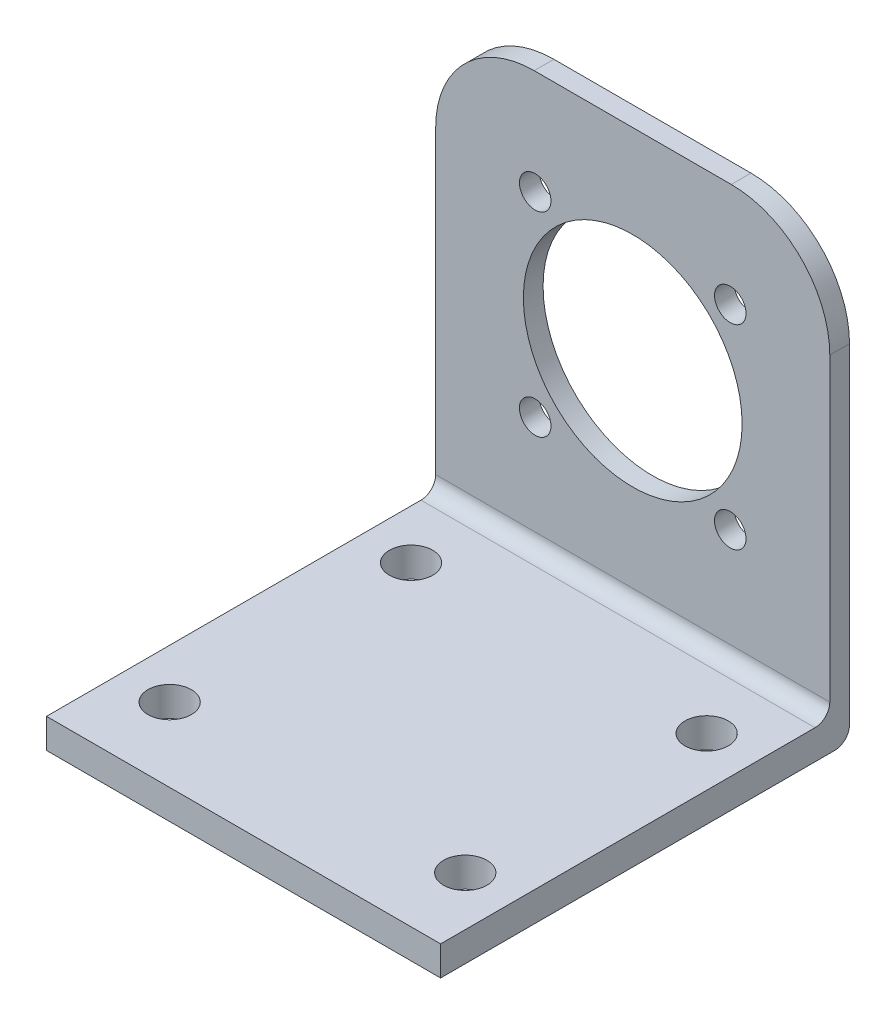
ISO-10303-21;
HEADER;
FILE_DESCRIPTION(('STEP AP214'),'2;1');
FILE_NAME('part.step','',(''),(''),'','','');
FILE_SCHEMA(('AUTOMOTIVE_DESIGN { 1 0 10303 214 1 1 1 1 }'));
ENDSEC;
DATA;
#1=APPLICATION_CONTEXT('core data for automotive mechanical design processes');
#2=APPLICATION_PROTOCOL_DEFINITION('international standard','automotive_design',2000,#1);
#3=PRODUCT_CONTEXT('',#1,'mechanical');
#4=PRODUCT('Part','Part','',(#3));
#5=PRODUCT_RELATED_PRODUCT_CATEGORY('part','',(#4));
#6=PRODUCT_DEFINITION_FORMATION('','',#4);
#7=PRODUCT_DEFINITION_CONTEXT('part definition',#1,'design');
#8=PRODUCT_DEFINITION('design','',#6,#7);
#9=PRODUCT_DEFINITION_SHAPE('','',#8);
#10=(LENGTH_UNIT() NAMED_UNIT(*) SI_UNIT(.MILLI.,.METRE.));
#11=(NAMED_UNIT(*) PLANE_ANGLE_UNIT() SI_UNIT($,.RADIAN.));
#12=(NAMED_UNIT(*) SI_UNIT($,.STERADIAN.) SOLID_ANGLE_UNIT());
#13=UNCERTAINTY_MEASURE_WITH_UNIT(LENGTH_MEASURE(1.E-05),#10,'distance_accuracy_value','');
#14=(GEOMETRIC_REPRESENTATION_CONTEXT(3) GLOBAL_UNCERTAINTY_ASSIGNED_CONTEXT((#13)) GLOBAL_UNIT_ASSIGNED_CONTEXT((#10,
#11,#12)) REPRESENTATION_CONTEXT('',''));
#15=CARTESIAN_POINT('',(0.,0.,0.));
#16=DIRECTION('',(0.,0.,1.));
#17=DIRECTION('',(1.,0.,0.));
#18=AXIS2_PLACEMENT_3D('',#15,#16,#17);
#19=CARTESIAN_POINT('',(9.99999999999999,12.5,2.));
#20=DIRECTION('',(0.,0.,-1.));
#21=DIRECTION('',(-1.,0.,0.));
#22=AXIS2_PLACEMENT_3D('',#19,#20,#21);
#23=PLANE('',#22);
#24=CARTESIAN_POINT('',(-9.89949493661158,11.8994949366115,2.));
#25=DIRECTION('',(0.,0.,1.));
#26=DIRECTION('',(1.,0.,0.));
#27=AXIS2_PLACEMENT_3D('',#24,#25,#26);
#28=CIRCLE('',#27,1.6);
#29=CARTESIAN_POINT('',(-8.29949493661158,11.8994949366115,2.));
#30=VERTEX_POINT('',#29);
#31=EDGE_CURVE('E427',#30,#30,#28,.T.);
#32=ORIENTED_EDGE('',*,*,#31,.F.);
#33=EDGE_LOOP('',(#32));
#34=FACE_BOUND('',#33,.T.);
#35=CARTESIAN_POINT('',(-9.89949493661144,-7.89949493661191,2.));
#36=DIRECTION('',(0.,0.,1.));
#37=DIRECTION('',(1.,0.,0.));
#38=AXIS2_PLACEMENT_3D('',#35,#36,#37);
#39=CIRCLE('',#38,1.6);
#40=CARTESIAN_POINT('',(-8.29949493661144,-7.89949493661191,2.));
#41=VERTEX_POINT('',#40);
#42=EDGE_CURVE('E428',#41,#41,#39,.T.);
#43=ORIENTED_EDGE('',*,*,#42,.F.);
#44=EDGE_LOOP('',(#43));
#45=FACE_BOUND('',#44,.T.);
#46=CARTESIAN_POINT('',(9.89949493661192,-7.8994949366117,2.));
#47=DIRECTION('',(0.,0.,1.));
#48=DIRECTION('',(1.,0.,0.));
#49=AXIS2_PLACEMENT_3D('',#46,#47,#48);
#50=CIRCLE('',#49,1.6);
#51=CARTESIAN_POINT('',(11.4994949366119,-7.8994949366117,2.));
#52=VERTEX_POINT('',#51);
#53=EDGE_CURVE('E431',#52,#52,#50,.T.);
#54=ORIENTED_EDGE('',*,*,#53,.F.);
#55=EDGE_LOOP('',(#54));
#56=FACE_BOUND('',#55,.T.);
#57=CARTESIAN_POINT('',(9.89949493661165,11.8994949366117,2.));
#58=DIRECTION('',(0.,0.,1.));
#59=DIRECTION('',(1.,0.,0.));
#60=AXIS2_PLACEMENT_3D('',#57,#58,#59);
#61=CIRCLE('',#60,1.6);
#62=CARTESIAN_POINT('',(11.4994949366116,11.8994949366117,2.));
#63=VERTEX_POINT('',#62);
#64=EDGE_CURVE('E203',#63,#63,#61,.T.);
#65=ORIENTED_EDGE('',*,*,#64,.F.);
#66=EDGE_LOOP('',(#65));
#67=FACE_BOUND('',#66,.T.);
#68=DIRECTION('',(0.,-1.,0.));
#69=VECTOR('',#68,1.);
#70=CARTESIAN_POINT('',(-20.,12.5,2.));
#71=LINE('',#70,#69);
#72=CARTESIAN_POINT('',(-20.,12.5,2.));
#73=VERTEX_POINT('',#72);
#74=CARTESIAN_POINT('',(-20.,-18.,2.));
#75=VERTEX_POINT('',#74);
#76=EDGE_CURVE('E148',#73,#75,#71,.T.);
#77=ORIENTED_EDGE('',*,*,#76,.T.);
#78=DIRECTION('',(1.,0.,0.));
#79=VECTOR('',#78,1.);
#80=CARTESIAN_POINT('',(10.,-18.,2.));
#81=LINE('',#80,#79);
#82=CARTESIAN_POINT('',(20.,-18.,2.));
#83=VERTEX_POINT('',#82);
#84=EDGE_CURVE('E194',#75,#83,#81,.T.);
#85=ORIENTED_EDGE('',*,*,#84,.T.);
#86=DIRECTION('',(0.,1.,0.));
#87=VECTOR('',#86,1.);
#88=CARTESIAN_POINT('',(20.,12.5,2.));
#89=LINE('',#88,#87);
#90=CARTESIAN_POINT('',(20.,12.5,2.));
#91=VERTEX_POINT('',#90);
#92=EDGE_CURVE('E150',#83,#91,#89,.T.);
#93=ORIENTED_EDGE('',*,*,#92,.T.);
#94=CARTESIAN_POINT('',(9.99999999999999,12.5,2.));
#95=DIRECTION('',(0.,0.,1.));
#96=DIRECTION('',(-1.,0.,0.));
#97=AXIS2_PLACEMENT_3D('',#94,#95,#96);
#98=CIRCLE('',#97,10.);
#99=CARTESIAN_POINT('',(9.99999999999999,22.5,2.));
#100=VERTEX_POINT('',#99);
#101=EDGE_CURVE('E153',#91,#100,#98,.T.);
#102=ORIENTED_EDGE('',*,*,#101,.T.);
#103=DIRECTION('',(-1.,0.,0.));
#104=VECTOR('',#103,1.);
#105=CARTESIAN_POINT('',(9.99999999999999,22.5,2.));
#106=LINE('',#105,#104);
#107=CARTESIAN_POINT('',(-10.,22.5,2.));
#108=VERTEX_POINT('',#107);
#109=EDGE_CURVE('E155',#100,#108,#106,.T.);
#110=ORIENTED_EDGE('',*,*,#109,.T.);
#111=CARTESIAN_POINT('',(-10.,12.5,2.));
#112=DIRECTION('',(0.,0.,1.));
#113=DIRECTION('',(1.,0.,0.));
#114=AXIS2_PLACEMENT_3D('',#111,#112,#113);
#115=CIRCLE('',#114,10.);
#116=EDGE_CURVE('E157',#108,#73,#115,.T.);
#117=ORIENTED_EDGE('',*,*,#116,.T.);
#118=EDGE_LOOP('',(#77,#85,#93,#102,#110,#117));
#119=FACE_BOUND('',#118,.T.);
#120=CARTESIAN_POINT('',(0.,1.99999999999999,2.));
#121=DIRECTION('',(0.,0.,1.));
#122=DIRECTION('',(1.,0.,0.));
#123=AXIS2_PLACEMENT_3D('',#120,#121,#122);
#124=CIRCLE('',#123,11.1);
#125=CARTESIAN_POINT('',(11.1,1.99999999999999,2.));
#126=VERTEX_POINT('',#125);
#127=EDGE_CURVE('E142',#126,#126,#124,.T.);
#128=ORIENTED_EDGE('',*,*,#127,.F.);
#129=EDGE_LOOP('',(#128));
#130=FACE_BOUND('',#129,.T.);
#131=ADVANCED_FACE('F36',(#34,#45,#56,#67,#119,#130),#23,.F.);
#132=CARTESIAN_POINT('',(9.99999999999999,12.5,0.));
#133=DIRECTION('',(0.,0.,-1.));
#134=DIRECTION('',(-1.,0.,0.));
#135=AXIS2_PLACEMENT_3D('',#132,#133,#134);
#136=PLANE('',#135);
#137=CARTESIAN_POINT('',(-9.89949493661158,11.8994949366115,0.));
#138=DIRECTION('',(0.,0.,-1.));
#139=DIRECTION('',(-1.,0.,0.));
#140=AXIS2_PLACEMENT_3D('',#137,#138,#139);
#141=CIRCLE('',#140,1.6);
#142=CARTESIAN_POINT('',(-11.4994949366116,11.8994949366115,0.));
#143=VERTEX_POINT('',#142);
#144=EDGE_CURVE('E40',#143,#143,#141,.T.);
#145=ORIENTED_EDGE('',*,*,#144,.F.);
#146=EDGE_LOOP('',(#145));
#147=FACE_BOUND('',#146,.T.);
#148=CARTESIAN_POINT('',(-9.89949493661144,-7.89949493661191,0.));
#149=DIRECTION('',(0.,0.,-1.));
#150=DIRECTION('',(-1.,0.,0.));
#151=AXIS2_PLACEMENT_3D('',#148,#149,#150);
#152=CIRCLE('',#151,1.6);
#153=CARTESIAN_POINT('',(-11.4994949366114,-7.89949493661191,0.));
#154=VERTEX_POINT('',#153);
#155=EDGE_CURVE('E205',#154,#154,#152,.T.);
#156=ORIENTED_EDGE('',*,*,#155,.F.);
#157=EDGE_LOOP('',(#156));
#158=FACE_BOUND('',#157,.T.);
#159=CARTESIAN_POINT('',(9.89949493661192,-7.8994949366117,0.));
#160=DIRECTION('',(0.,0.,-1.));
#161=DIRECTION('',(-1.,0.,0.));
#162=AXIS2_PLACEMENT_3D('',#159,#160,#161);
#163=CIRCLE('',#162,1.6);
#164=CARTESIAN_POINT('',(8.29949493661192,-7.8994949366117,0.));
#165=VERTEX_POINT('',#164);
#166=EDGE_CURVE('E202',#165,#165,#163,.T.);
#167=ORIENTED_EDGE('',*,*,#166,.F.);
#168=EDGE_LOOP('',(#167));
#169=FACE_BOUND('',#168,.T.);
#170=CARTESIAN_POINT('',(9.89949493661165,11.8994949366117,0.));
#171=DIRECTION('',(0.,0.,-1.));
#172=DIRECTION('',(-1.,0.,0.));
#173=AXIS2_PLACEMENT_3D('',#170,#171,#172);
#174=CIRCLE('',#173,1.6);
#175=CARTESIAN_POINT('',(8.29949493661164,11.8994949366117,0.));
#176=VERTEX_POINT('',#175);
#177=EDGE_CURVE('E199',#176,#176,#174,.T.);
#178=ORIENTED_EDGE('',*,*,#177,.F.);
#179=EDGE_LOOP('',(#178));
#180=FACE_BOUND('',#179,.T.);
#181=DIRECTION('',(0.,1.,0.));
#182=VECTOR('',#181,1.);
#183=CARTESIAN_POINT('',(20.,12.5,0.));
#184=LINE('',#183,#182);
#185=CARTESIAN_POINT('',(20.,-21.,0.));
#186=VERTEX_POINT('',#185);
#187=CARTESIAN_POINT('',(20.,12.5,0.));
#188=VERTEX_POINT('',#187);
#189=EDGE_CURVE('E162',#186,#188,#184,.T.);
#190=ORIENTED_EDGE('',*,*,#189,.F.);
#191=DIRECTION('',(1.,0.,0.));
#192=VECTOR('',#191,1.);
#193=CARTESIAN_POINT('',(-20.,-21.,0.));
#194=LINE('',#193,#192);
#195=CARTESIAN_POINT('',(-20.,-21.,0.));
#196=VERTEX_POINT('',#195);
#197=EDGE_CURVE('E190',#186,#196,#194,.F.);
#198=ORIENTED_EDGE('',*,*,#197,.T.);
#199=DIRECTION('',(0.,-1.,0.));
#200=VECTOR('',#199,1.);
#201=CARTESIAN_POINT('',(-20.,12.5,0.));
#202=LINE('',#201,#200);
#203=CARTESIAN_POINT('',(-20.,12.5,0.));
#204=VERTEX_POINT('',#203);
#205=EDGE_CURVE('E145',#204,#196,#202,.T.);
#206=ORIENTED_EDGE('',*,*,#205,.F.);
#207=CARTESIAN_POINT('',(-10.,12.5,0.));
#208=DIRECTION('',(0.,0.,1.));
#209=DIRECTION('',(1.,0.,0.));
#210=AXIS2_PLACEMENT_3D('',#207,#208,#209);
#211=CIRCLE('',#210,10.);
#212=CARTESIAN_POINT('',(-10.,22.5,0.));
#213=VERTEX_POINT('',#212);
#214=EDGE_CURVE('E151',#213,#204,#211,.T.);
#215=ORIENTED_EDGE('',*,*,#214,.F.);
#216=DIRECTION('',(-1.,0.,0.));
#217=VECTOR('',#216,1.);
#218=CARTESIAN_POINT('',(9.99999999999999,22.5,0.));
#219=LINE('',#218,#217);
#220=CARTESIAN_POINT('',(9.99999999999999,22.5,0.));
#221=VERTEX_POINT('',#220);
#222=EDGE_CURVE('E166',#221,#213,#219,.T.);
#223=ORIENTED_EDGE('',*,*,#222,.F.);
#224=CARTESIAN_POINT('',(9.99999999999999,12.5,0.));
#225=DIRECTION('',(0.,0.,1.));
#226=DIRECTION('',(-1.,0.,0.));
#227=AXIS2_PLACEMENT_3D('',#224,#225,#226);
#228=CIRCLE('',#227,10.);
#229=EDGE_CURVE('E164',#188,#221,#228,.T.);
#230=ORIENTED_EDGE('',*,*,#229,.F.);
#231=EDGE_LOOP('',(#190,#198,#206,#215,#223,#230));
#232=FACE_BOUND('',#231,.T.);
#233=CARTESIAN_POINT('',(0.,1.99999999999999,0.));
#234=DIRECTION('',(0.,0.,1.));
#235=DIRECTION('',(1.,0.,0.));
#236=AXIS2_PLACEMENT_3D('',#233,#234,#235);
#237=CIRCLE('',#236,11.1);
#238=CARTESIAN_POINT('',(11.1,1.99999999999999,0.));
#239=VERTEX_POINT('',#238);
#240=EDGE_CURVE('E141',#239,#239,#237,.T.);
#241=ORIENTED_EDGE('',*,*,#240,.T.);
#242=EDGE_LOOP('',(#241));
#243=FACE_BOUND('',#242,.T.);
#244=ADVANCED_FACE('F238',(#147,#158,#169,#180,#232,#243),#136,.T.);
#245=CARTESIAN_POINT('',(-20.,12.5,2.));
#246=DIRECTION('',(1.,0.,0.));
#247=DIRECTION('',(0.,1.,0.));
#248=AXIS2_PLACEMENT_3D('',#245,#246,#247);
#249=PLANE('',#248);
#250=ORIENTED_EDGE('',*,*,#205,.T.);
#251=CARTESIAN_POINT('',(-20.,-21.,1.5));
#252=DIRECTION('',(1.,0.,0.));
#253=DIRECTION('',(0.,1.,0.));
#254=AXIS2_PLACEMENT_3D('',#251,#252,#253);
#255=CIRCLE('',#254,1.5);
#256=CARTESIAN_POINT('',(-20.,-22.5,1.5));
#257=VERTEX_POINT('',#256);
#258=EDGE_CURVE('E192',#196,#257,#255,.F.);
#259=ORIENTED_EDGE('',*,*,#258,.T.);
#260=DIRECTION('',(0.,0.,-1.));
#261=VECTOR('',#260,1.);
#262=CARTESIAN_POINT('',(-20.,-22.5,2.));
#263=LINE('',#262,#261);
#264=CARTESIAN_POINT('',(-20.,-22.5,41.5));
#265=VERTEX_POINT('',#264);
#266=EDGE_CURVE('E182',#265,#257,#263,.T.);
#267=ORIENTED_EDGE('',*,*,#266,.F.);
#268=DIRECTION('',(0.,1.,0.));
#269=VECTOR('',#268,1.);
#270=CARTESIAN_POINT('',(-20.,-22.5,41.5));
#271=LINE('',#270,#269);
#272=CARTESIAN_POINT('',(-20.,-19.5,41.5));
#273=VERTEX_POINT('',#272);
#274=EDGE_CURVE('E138',#265,#273,#271,.T.);
#275=ORIENTED_EDGE('',*,*,#274,.T.);
#276=DIRECTION('',(0.,0.,-1.));
#277=VECTOR('',#276,1.);
#278=CARTESIAN_POINT('',(-20.,-19.5,0.));
#279=LINE('',#278,#277);
#280=CARTESIAN_POINT('',(-20.,-19.5,3.5));
#281=VERTEX_POINT('',#280);
#282=EDGE_CURVE('E127',#273,#281,#279,.T.);
#283=ORIENTED_EDGE('',*,*,#282,.T.);
#284=CARTESIAN_POINT('',(-20.,-18.,3.5));
#285=DIRECTION('',(1.,0.,0.));
#286=DIRECTION('',(0.,1.,0.));
#287=AXIS2_PLACEMENT_3D('',#284,#285,#286);
#288=CIRCLE('',#287,1.5);
#289=EDGE_CURVE('E11',#281,#75,#288,.T.);
#290=ORIENTED_EDGE('',*,*,#289,.T.);
#291=ORIENTED_EDGE('',*,*,#76,.F.);
#292=DIRECTION('',(0.,0.,-1.));
#293=VECTOR('',#292,1.);
#294=CARTESIAN_POINT('',(-20.,12.5,2.));
#295=LINE('',#294,#293);
#296=EDGE_CURVE('E159',#73,#204,#295,.T.);
#297=ORIENTED_EDGE('',*,*,#296,.T.);
#298=EDGE_LOOP('',(#250,#259,#267,#275,#283,#290,#291,#297));
#299=FACE_BOUND('',#298,.T.);
#300=ADVANCED_FACE('F228',(#299),#249,.F.);
#301=CARTESIAN_POINT('',(20.,-22.5,2.));
#302=DIRECTION('',(0.,1.,0.));
#303=DIRECTION('',(-1.,0.,0.));
#304=AXIS2_PLACEMENT_3D('',#301,#302,#303);
#305=PLANE('',#304);
#306=CARTESIAN_POINT('',(15.,-22.5,34.));
#307=DIRECTION('',(0.,1.,0.));
#308=DIRECTION('',(1.,0.,0.));
#309=AXIS2_PLACEMENT_3D('',#306,#307,#308);
#310=CIRCLE('',#309,2.2);
#311=CARTESIAN_POINT('',(17.2,-22.5,34.));
#312=VERTEX_POINT('',#311);
#313=EDGE_CURVE('E214',#312,#312,#310,.T.);
#314=ORIENTED_EDGE('',*,*,#313,.T.);
#315=EDGE_LOOP('',(#314));
#316=FACE_BOUND('',#315,.T.);
#317=CARTESIAN_POINT('',(15.,-22.5,9.5));
#318=DIRECTION('',(0.,1.,0.));
#319=DIRECTION('',(1.,0.,0.));
#320=AXIS2_PLACEMENT_3D('',#317,#318,#319);
#321=CIRCLE('',#320,2.2);
#322=CARTESIAN_POINT('',(17.2,-22.5,9.5));
#323=VERTEX_POINT('',#322);
#324=EDGE_CURVE('E442',#323,#323,#321,.T.);
#325=ORIENTED_EDGE('',*,*,#324,.T.);
#326=EDGE_LOOP('',(#325));
#327=FACE_BOUND('',#326,.T.);
#328=CARTESIAN_POINT('',(-15.,-22.5,9.5));
#329=DIRECTION('',(0.,1.,0.));
#330=DIRECTION('',(-1.,0.,0.));
#331=AXIS2_PLACEMENT_3D('',#328,#329,#330);
#332=CIRCLE('',#331,2.2);
#333=CARTESIAN_POINT('',(-17.2,-22.5,9.5));
#334=VERTEX_POINT('',#333);
#335=EDGE_CURVE('E227',#334,#334,#332,.T.);
#336=ORIENTED_EDGE('',*,*,#335,.T.);
#337=EDGE_LOOP('',(#336));
#338=FACE_BOUND('',#337,.T.);
#339=CARTESIAN_POINT('',(-15.,-22.5,34.));
#340=DIRECTION('',(0.,1.,0.));
#341=DIRECTION('',(-1.,0.,0.));
#342=AXIS2_PLACEMENT_3D('',#339,#340,#341);
#343=CIRCLE('',#342,2.2);
#344=CARTESIAN_POINT('',(-17.2,-22.5,34.));
#345=VERTEX_POINT('',#344);
#346=EDGE_CURVE('E122',#345,#345,#343,.T.);
#347=ORIENTED_EDGE('',*,*,#346,.T.);
#348=EDGE_LOOP('',(#347));
#349=FACE_BOUND('',#348,.T.);
#350=ORIENTED_EDGE('',*,*,#266,.T.);
#351=DIRECTION('',(1.,0.,0.));
#352=VECTOR('',#351,1.);
#353=CARTESIAN_POINT('',(20.,-22.5,1.5));
#354=LINE('',#353,#352);
#355=CARTESIAN_POINT('',(20.,-22.5,1.5));
#356=VERTEX_POINT('',#355);
#357=EDGE_CURVE('E185',#257,#356,#354,.T.);
#358=ORIENTED_EDGE('',*,*,#357,.T.);
#359=DIRECTION('',(0.,0.,-1.));
#360=VECTOR('',#359,1.);
#361=CARTESIAN_POINT('',(20.,-22.5,2.));
#362=LINE('',#361,#360);
#363=CARTESIAN_POINT('',(20.,-22.5,41.5));
#364=VERTEX_POINT('',#363);
#365=EDGE_CURVE('E180',#364,#356,#362,.T.);
#366=ORIENTED_EDGE('',*,*,#365,.F.);
#367=DIRECTION('',(1.,0.,0.));
#368=VECTOR('',#367,1.);
#369=CARTESIAN_POINT('',(-61.6082924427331,-22.5,41.5));
#370=LINE('',#369,#368);
#371=EDGE_CURVE('E130',#265,#364,#370,.T.);
#372=ORIENTED_EDGE('',*,*,#371,.F.);
#373=EDGE_LOOP('',(#350,#358,#366,#372));
#374=FACE_BOUND('',#373,.T.);
#375=ADVANCED_FACE('F230',(#316,#327,#338,#349,#374),#305,.F.);
#376=CARTESIAN_POINT('',(20.,12.5,2.));
#377=DIRECTION('',(-1.,0.,0.));
#378=DIRECTION('',(0.,-1.,0.));
#379=AXIS2_PLACEMENT_3D('',#376,#377,#378);
#380=PLANE('',#379);
#381=ORIENTED_EDGE('',*,*,#365,.T.);
#382=CARTESIAN_POINT('',(20.,-21.,1.5));
#383=DIRECTION('',(-1.,0.,0.));
#384=DIRECTION('',(0.,-1.,0.));
#385=AXIS2_PLACEMENT_3D('',#382,#383,#384);
#386=CIRCLE('',#385,1.5);
#387=EDGE_CURVE('E188',#356,#186,#386,.F.);
#388=ORIENTED_EDGE('',*,*,#387,.T.);
#389=ORIENTED_EDGE('',*,*,#189,.T.);
#390=DIRECTION('',(0.,0.,-1.));
#391=VECTOR('',#390,1.);
#392=CARTESIAN_POINT('',(20.,12.5,2.));
#393=LINE('',#392,#391);
#394=EDGE_CURVE('E177',#91,#188,#393,.T.);
#395=ORIENTED_EDGE('',*,*,#394,.F.);
#396=ORIENTED_EDGE('',*,*,#92,.F.);
#397=CARTESIAN_POINT('',(20.,-18.,3.5));
#398=DIRECTION('',(-1.,0.,0.));
#399=DIRECTION('',(0.,-1.,0.));
#400=AXIS2_PLACEMENT_3D('',#397,#398,#399);
#401=CIRCLE('',#400,1.5);
#402=CARTESIAN_POINT('',(20.,-19.5,3.5));
#403=VERTEX_POINT('',#402);
#404=EDGE_CURVE('E45',#83,#403,#401,.T.);
#405=ORIENTED_EDGE('',*,*,#404,.T.);
#406=DIRECTION('',(0.,0.,1.));
#407=VECTOR('',#406,1.);
#408=CARTESIAN_POINT('',(20.,-19.5,0.));
#409=LINE('',#408,#407);
#410=CARTESIAN_POINT('',(20.,-19.5,41.5));
#411=VERTEX_POINT('',#410);
#412=EDGE_CURVE('E115',#403,#411,#409,.T.);
#413=ORIENTED_EDGE('',*,*,#412,.T.);
#414=DIRECTION('',(0.,-1.,0.));
#415=VECTOR('',#414,1.);
#416=CARTESIAN_POINT('',(20.,-22.5,41.5));
#417=LINE('',#416,#415);
#418=EDGE_CURVE('E120',#411,#364,#417,.T.);
#419=ORIENTED_EDGE('',*,*,#418,.T.);
#420=EDGE_LOOP('',(#381,#388,#389,#395,#396,#405,#413,#419));
#421=FACE_BOUND('',#420,.T.);
#422=ADVANCED_FACE('F118',(#421),#380,.F.);
#423=CARTESIAN_POINT('',(9.99999999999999,12.5,2.));
#424=DIRECTION('',(0.,0.,-1.));
#425=DIRECTION('',(-1.,0.,0.));
#426=AXIS2_PLACEMENT_3D('',#423,#424,#425);
#427=CYLINDRICAL_SURFACE('',#426,10.);
#428=ORIENTED_EDGE('',*,*,#229,.T.);
#429=DIRECTION('',(0.,0.,-1.));
#430=VECTOR('',#429,1.);
#431=CARTESIAN_POINT('',(9.99999999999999,22.5,2.));
#432=LINE('',#431,#430);
#433=EDGE_CURVE('E174',#100,#221,#432,.T.);
#434=ORIENTED_EDGE('',*,*,#433,.F.);
#435=ORIENTED_EDGE('',*,*,#101,.F.);
#436=ORIENTED_EDGE('',*,*,#394,.T.);
#437=EDGE_LOOP('',(#428,#434,#435,#436));
#438=FACE_BOUND('',#437,.T.);
#439=ADVANCED_FACE('F256',(#438),#427,.T.);
#440=CARTESIAN_POINT('',(9.99999999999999,22.5,2.));
#441=DIRECTION('',(0.,-1.,0.));
#442=DIRECTION('',(0.,0.,-1.));
#443=AXIS2_PLACEMENT_3D('',#440,#441,#442);
#444=PLANE('',#443);
#445=ORIENTED_EDGE('',*,*,#222,.T.);
#446=DIRECTION('',(0.,0.,-1.));
#447=VECTOR('',#446,1.);
#448=CARTESIAN_POINT('',(-10.,22.5,2.));
#449=LINE('',#448,#447);
#450=EDGE_CURVE('E171',#108,#213,#449,.T.);
#451=ORIENTED_EDGE('',*,*,#450,.F.);
#452=ORIENTED_EDGE('',*,*,#109,.F.);
#453=ORIENTED_EDGE('',*,*,#433,.T.);
#454=EDGE_LOOP('',(#445,#451,#452,#453));
#455=FACE_BOUND('',#454,.T.);
#456=ADVANCED_FACE('F252',(#455),#444,.F.);
#457=CARTESIAN_POINT('',(-10.,12.5,2.));
#458=DIRECTION('',(0.,0.,-1.));
#459=DIRECTION('',(-1.,0.,0.));
#460=AXIS2_PLACEMENT_3D('',#457,#458,#459);
#461=CYLINDRICAL_SURFACE('',#460,10.);
#462=ORIENTED_EDGE('',*,*,#214,.T.);
#463=ORIENTED_EDGE('',*,*,#296,.F.);
#464=ORIENTED_EDGE('',*,*,#116,.F.);
#465=ORIENTED_EDGE('',*,*,#450,.T.);
#466=EDGE_LOOP('',(#462,#463,#464,#465));
#467=FACE_BOUND('',#466,.T.);
#468=ADVANCED_FACE('F247',(#467),#461,.T.);
#469=CARTESIAN_POINT('',(0.,1.99999999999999,2.));
#470=DIRECTION('',(0.,0.,-1.));
#471=DIRECTION('',(-1.,0.,0.));
#472=AXIS2_PLACEMENT_3D('',#469,#470,#471);
#473=CYLINDRICAL_SURFACE('',#472,11.1);
#474=ORIENTED_EDGE('',*,*,#127,.T.);
#475=EDGE_LOOP('',(#474));
#476=FACE_BOUND('',#475,.T.);
#477=ORIENTED_EDGE('',*,*,#240,.F.);
#478=EDGE_LOOP('',(#477));
#479=FACE_BOUND('',#478,.T.);
#480=ADVANCED_FACE('F282',(#476,#479),#473,.F.);
#481=CARTESIAN_POINT('',(-61.6082924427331,-19.5,0.));
#482=DIRECTION('',(0.,1.,0.));
#483=DIRECTION('',(-1.,0.,0.));
#484=AXIS2_PLACEMENT_3D('',#481,#482,#483);
#485=PLANE('',#484);
#486=CARTESIAN_POINT('',(15.,-19.5,34.));
#487=DIRECTION('',(0.,1.,0.));
#488=DIRECTION('',(1.,0.,0.));
#489=AXIS2_PLACEMENT_3D('',#486,#487,#488);
#490=CIRCLE('',#489,2.2);
#491=CARTESIAN_POINT('',(17.2,-19.5,34.));
#492=VERTEX_POINT('',#491);
#493=EDGE_CURVE('E210',#492,#492,#490,.T.);
#494=ORIENTED_EDGE('',*,*,#493,.F.);
#495=EDGE_LOOP('',(#494));
#496=FACE_BOUND('',#495,.T.);
#497=CARTESIAN_POINT('',(15.,-19.5,9.5));
#498=DIRECTION('',(0.,1.,0.));
#499=DIRECTION('',(1.,0.,0.));
#500=AXIS2_PLACEMENT_3D('',#497,#498,#499);
#501=CIRCLE('',#500,2.2);
#502=CARTESIAN_POINT('',(17.2,-19.5,9.5));
#503=VERTEX_POINT('',#502);
#504=EDGE_CURVE('E219',#503,#503,#501,.T.);
#505=ORIENTED_EDGE('',*,*,#504,.F.);
#506=EDGE_LOOP('',(#505));
#507=FACE_BOUND('',#506,.T.);
#508=CARTESIAN_POINT('',(-15.,-19.5,9.5));
#509=DIRECTION('',(0.,1.,0.));
#510=DIRECTION('',(-1.,0.,0.));
#511=AXIS2_PLACEMENT_3D('',#508,#509,#510);
#512=CIRCLE('',#511,2.2);
#513=CARTESIAN_POINT('',(-17.2,-19.5,9.5));
#514=VERTEX_POINT('',#513);
#515=EDGE_CURVE('E439',#514,#514,#512,.T.);
#516=ORIENTED_EDGE('',*,*,#515,.F.);
#517=EDGE_LOOP('',(#516));
#518=FACE_BOUND('',#517,.T.);
#519=CARTESIAN_POINT('',(-15.,-19.5,34.));
#520=DIRECTION('',(0.,1.,0.));
#521=DIRECTION('',(-1.,0.,0.));
#522=AXIS2_PLACEMENT_3D('',#519,#520,#521);
#523=CIRCLE('',#522,2.2);
#524=CARTESIAN_POINT('',(-17.2,-19.5,34.));
#525=VERTEX_POINT('',#524);
#526=EDGE_CURVE('E225',#525,#525,#523,.T.);
#527=ORIENTED_EDGE('',*,*,#526,.F.);
#528=EDGE_LOOP('',(#527));
#529=FACE_BOUND('',#528,.T.);
#530=ORIENTED_EDGE('',*,*,#412,.F.);
#531=DIRECTION('',(1.,0.,0.));
#532=VECTOR('',#531,1.);
#533=CARTESIAN_POINT('',(-61.6082924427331,-19.5,3.5));
#534=LINE('',#533,#532);
#535=EDGE_CURVE('E59',#403,#281,#534,.F.);
#536=ORIENTED_EDGE('',*,*,#535,.T.);
#537=ORIENTED_EDGE('',*,*,#282,.F.);
#538=DIRECTION('',(1.,0.,0.));
#539=VECTOR('',#538,1.);
#540=CARTESIAN_POINT('',(-61.6082924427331,-19.5,41.5));
#541=LINE('',#540,#539);
#542=EDGE_CURVE('E125',#273,#411,#541,.T.);
#543=ORIENTED_EDGE('',*,*,#542,.T.);
#544=EDGE_LOOP('',(#530,#536,#537,#543));
#545=FACE_BOUND('',#544,.T.);
#546=ADVANCED_FACE('F126',(#496,#507,#518,#529,#545),#485,.T.);
#547=CARTESIAN_POINT('',(-61.6082924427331,-22.5,41.5));
#548=DIRECTION('',(0.,0.,1.));
#549=DIRECTION('',(1.,0.,0.));
#550=AXIS2_PLACEMENT_3D('',#547,#548,#549);
#551=PLANE('',#550);
#552=ORIENTED_EDGE('',*,*,#274,.F.);
#553=ORIENTED_EDGE('',*,*,#371,.T.);
#554=ORIENTED_EDGE('',*,*,#418,.F.);
#555=ORIENTED_EDGE('',*,*,#542,.F.);
#556=EDGE_LOOP('',(#552,#553,#554,#555));
#557=FACE_BOUND('',#556,.T.);
#558=ADVANCED_FACE('F133',(#557),#551,.T.);
#559=CARTESIAN_POINT('',(20.,-21.,1.5));
#560=DIRECTION('',(-1.,0.,0.));
#561=DIRECTION('',(0.,-1.,0.));
#562=AXIS2_PLACEMENT_3D('',#559,#560,#561);
#563=CYLINDRICAL_SURFACE('',#562,1.5);
#564=ORIENTED_EDGE('',*,*,#258,.F.);
#565=ORIENTED_EDGE('',*,*,#197,.F.);
#566=ORIENTED_EDGE('',*,*,#387,.F.);
#567=ORIENTED_EDGE('',*,*,#357,.F.);
#568=EDGE_LOOP('',(#564,#565,#566,#567));
#569=FACE_BOUND('',#568,.T.);
#570=ADVANCED_FACE('F243',(#569),#563,.T.);
#571=CARTESIAN_POINT('',(10.,-18.,3.5));
#572=DIRECTION('',(1.,0.,0.));
#573=DIRECTION('',(0.,1.,0.));
#574=AXIS2_PLACEMENT_3D('',#571,#572,#573);
#575=CYLINDRICAL_SURFACE('',#574,1.5);
#576=ORIENTED_EDGE('',*,*,#289,.F.);
#577=ORIENTED_EDGE('',*,*,#535,.F.);
#578=ORIENTED_EDGE('',*,*,#404,.F.);
#579=ORIENTED_EDGE('',*,*,#84,.F.);
#580=EDGE_LOOP('',(#576,#577,#578,#579));
#581=FACE_BOUND('',#580,.T.);
#582=ADVANCED_FACE('F38',(#581),#575,.F.);
#583=CARTESIAN_POINT('',(-15.,-22.5,34.));
#584=DIRECTION('',(0.,1.,0.));
#585=DIRECTION('',(-1.,0.,0.));
#586=AXIS2_PLACEMENT_3D('',#583,#584,#585);
#587=CYLINDRICAL_SURFACE('',#586,2.2);
#588=ORIENTED_EDGE('',*,*,#346,.F.);
#589=EDGE_LOOP('',(#588));
#590=FACE_BOUND('',#589,.T.);
#591=ORIENTED_EDGE('',*,*,#526,.T.);
#592=EDGE_LOOP('',(#591));
#593=FACE_BOUND('',#592,.T.);
#594=ADVANCED_FACE('F262',(#590,#593),#587,.F.);
#595=CARTESIAN_POINT('',(-15.,-22.5,9.5));
#596=DIRECTION('',(0.,1.,0.));
#597=DIRECTION('',(-1.,0.,0.));
#598=AXIS2_PLACEMENT_3D('',#595,#596,#597);
#599=CYLINDRICAL_SURFACE('',#598,2.2);
#600=ORIENTED_EDGE('',*,*,#335,.F.);
#601=EDGE_LOOP('',(#600));
#602=FACE_BOUND('',#601,.T.);
#603=ORIENTED_EDGE('',*,*,#515,.T.);
#604=EDGE_LOOP('',(#603));
#605=FACE_BOUND('',#604,.T.);
#606=ADVANCED_FACE('F268',(#602,#605),#599,.F.);
#607=CARTESIAN_POINT('',(15.,-22.5,9.5));
#608=DIRECTION('',(0.,1.,0.));
#609=DIRECTION('',(-1.,0.,0.));
#610=AXIS2_PLACEMENT_3D('',#607,#608,#609);
#611=CYLINDRICAL_SURFACE('',#610,2.2);
#612=ORIENTED_EDGE('',*,*,#324,.F.);
#613=EDGE_LOOP('',(#612));
#614=FACE_BOUND('',#613,.T.);
#615=ORIENTED_EDGE('',*,*,#504,.T.);
#616=EDGE_LOOP('',(#615));
#617=FACE_BOUND('',#616,.T.);
#618=ADVANCED_FACE('F362',(#614,#617),#611,.F.);
#619=CARTESIAN_POINT('',(15.,-22.5,34.));
#620=DIRECTION('',(0.,1.,0.));
#621=DIRECTION('',(-1.,0.,0.));
#622=AXIS2_PLACEMENT_3D('',#619,#620,#621);
#623=CYLINDRICAL_SURFACE('',#622,2.2);
#624=ORIENTED_EDGE('',*,*,#313,.F.);
#625=EDGE_LOOP('',(#624));
#626=FACE_BOUND('',#625,.T.);
#627=ORIENTED_EDGE('',*,*,#493,.T.);
#628=EDGE_LOOP('',(#627));
#629=FACE_BOUND('',#628,.T.);
#630=ADVANCED_FACE('F371',(#626,#629),#623,.F.);
#631=CARTESIAN_POINT('',(9.89949493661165,11.8994949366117,-1.));
#632=DIRECTION('',(0.,0.,1.));
#633=DIRECTION('',(1.,0.,0.));
#634=AXIS2_PLACEMENT_3D('',#631,#632,#633);
#635=CYLINDRICAL_SURFACE('',#634,1.6);
#636=ORIENTED_EDGE('',*,*,#177,.T.);
#637=EDGE_LOOP('',(#636));
#638=FACE_BOUND('',#637,.T.);
#639=ORIENTED_EDGE('',*,*,#64,.T.);
#640=EDGE_LOOP('',(#639));
#641=FACE_BOUND('',#640,.T.);
#642=ADVANCED_FACE('F380',(#638,#641),#635,.F.);
#643=CARTESIAN_POINT('',(9.89949493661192,-7.8994949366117,-1.));
#644=DIRECTION('',(0.,0.,1.));
#645=DIRECTION('',(1.,0.,0.));
#646=AXIS2_PLACEMENT_3D('',#643,#644,#645);
#647=CYLINDRICAL_SURFACE('',#646,1.6);
#648=ORIENTED_EDGE('',*,*,#166,.T.);
#649=EDGE_LOOP('',(#648));
#650=FACE_BOUND('',#649,.T.);
#651=ORIENTED_EDGE('',*,*,#53,.T.);
#652=EDGE_LOOP('',(#651));
#653=FACE_BOUND('',#652,.T.);
#654=ADVANCED_FACE('F389',(#650,#653),#647,.F.);
#655=CARTESIAN_POINT('',(-9.89949493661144,-7.89949493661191,-1.));
#656=DIRECTION('',(0.,0.,1.));
#657=DIRECTION('',(1.,0.,0.));
#658=AXIS2_PLACEMENT_3D('',#655,#656,#657);
#659=CYLINDRICAL_SURFACE('',#658,1.6);
#660=ORIENTED_EDGE('',*,*,#155,.T.);
#661=EDGE_LOOP('',(#660));
#662=FACE_BOUND('',#661,.T.);
#663=ORIENTED_EDGE('',*,*,#42,.T.);
#664=EDGE_LOOP('',(#663));
#665=FACE_BOUND('',#664,.T.);
#666=ADVANCED_FACE('F398',(#662,#665),#659,.F.);
#667=CARTESIAN_POINT('',(-9.89949493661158,11.8994949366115,-1.));
#668=DIRECTION('',(0.,0.,1.));
#669=DIRECTION('',(1.,0.,0.));
#670=AXIS2_PLACEMENT_3D('',#667,#668,#669);
#671=CYLINDRICAL_SURFACE('',#670,1.6);
#672=ORIENTED_EDGE('',*,*,#144,.T.);
#673=EDGE_LOOP('',(#672));
#674=FACE_BOUND('',#673,.T.);
#675=ORIENTED_EDGE('',*,*,#31,.T.);
#676=EDGE_LOOP('',(#675));
#677=FACE_BOUND('',#676,.T.);
#678=ADVANCED_FACE('F407',(#674,#677),#671,.F.);
#679=CLOSED_SHELL('',(#131,#244,#300,#375,#422,#439,#456,#468,#480,#546,#558,#570,#582,#594,
#606,#618,#630,#642,#654,#666,#678));
#680=MANIFOLD_SOLID_BREP('B2',#679);
#681=ADVANCED_BREP_SHAPE_REPRESENTATION('',(#18,#680),#14);
#682=SHAPE_DEFINITION_REPRESENTATION(#9,#681);
ENDSEC;
END-ISO-10303-21;
